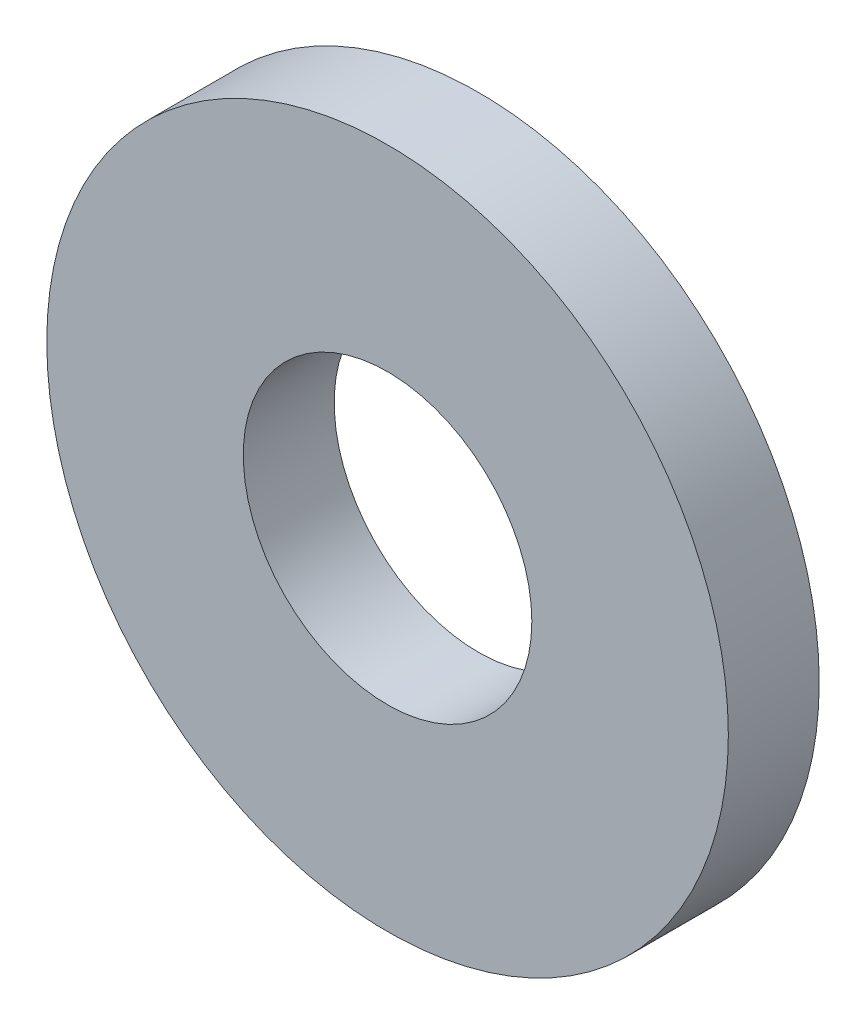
ISO-10303-21;
HEADER;
FILE_DESCRIPTION(('STEP AP214'),'2;1');
FILE_NAME('part.step','',(''),(''),'','','');
FILE_SCHEMA(('AUTOMOTIVE_DESIGN { 1 0 10303 214 1 1 1 1 }'));
ENDSEC;
DATA;
#1=APPLICATION_CONTEXT('core data for automotive mechanical design processes');
#2=APPLICATION_PROTOCOL_DEFINITION('international standard','automotive_design',2000,#1);
#3=PRODUCT_CONTEXT('',#1,'mechanical');
#4=PRODUCT('Part','Part','',(#3));
#5=PRODUCT_RELATED_PRODUCT_CATEGORY('part','',(#4));
#6=PRODUCT_DEFINITION_FORMATION('','',#4);
#7=PRODUCT_DEFINITION_CONTEXT('part definition',#1,'design');
#8=PRODUCT_DEFINITION('design','',#6,#7);
#9=PRODUCT_DEFINITION_SHAPE('','',#8);
#10=(LENGTH_UNIT() NAMED_UNIT(*) SI_UNIT(.MILLI.,.METRE.));
#11=(NAMED_UNIT(*) PLANE_ANGLE_UNIT() SI_UNIT($,.RADIAN.));
#12=(NAMED_UNIT(*) SI_UNIT($,.STERADIAN.) SOLID_ANGLE_UNIT());
#13=UNCERTAINTY_MEASURE_WITH_UNIT(LENGTH_MEASURE(1.E-05),#10,'distance_accuracy_value','');
#14=(GEOMETRIC_REPRESENTATION_CONTEXT(3) GLOBAL_UNCERTAINTY_ASSIGNED_CONTEXT((#13)) GLOBAL_UNIT_ASSIGNED_CONTEXT((#10,
#11,#12)) REPRESENTATION_CONTEXT('',''));
#15=CARTESIAN_POINT('',(0.,0.,0.));
#16=DIRECTION('',(0.,0.,1.));
#17=DIRECTION('',(1.,0.,0.));
#18=AXIS2_PLACEMENT_3D('',#15,#16,#17);
#19=CARTESIAN_POINT('',(0.,0.,4.));
#20=DIRECTION('',(0.,0.,1.));
#21=DIRECTION('',(1.,0.,0.));
#22=AXIS2_PLACEMENT_3D('',#19,#20,#21);
#23=PLANE('',#22);
#24=CARTESIAN_POINT('',(0.,0.,4.));
#25=DIRECTION('',(0.,0.,1.));
#26=DIRECTION('',(1.,0.,0.));
#27=AXIS2_PLACEMENT_3D('',#24,#25,#26);
#28=CIRCLE('',#27,15.);
#29=CARTESIAN_POINT('',(15.,0.,4.));
#30=VERTEX_POINT('',#29);
#31=EDGE_CURVE('E10',#30,#30,#28,.T.);
#32=ORIENTED_EDGE('',*,*,#31,.T.);
#33=EDGE_LOOP('',(#32));
#34=FACE_BOUND('',#33,.T.);
#35=CARTESIAN_POINT('',(0.,0.,4.));
#36=DIRECTION('',(0.,0.,1.));
#37=DIRECTION('',(1.,0.,0.));
#38=AXIS2_PLACEMENT_3D('',#35,#36,#37);
#39=CIRCLE('',#38,6.35);
#40=CARTESIAN_POINT('',(6.35,0.,4.));
#41=VERTEX_POINT('',#40);
#42=EDGE_CURVE('E39',#41,#41,#39,.T.);
#43=ORIENTED_EDGE('',*,*,#42,.F.);
#44=EDGE_LOOP('',(#43));
#45=FACE_BOUND('',#44,.T.);
#46=ADVANCED_FACE('F28',(#34,#45),#23,.T.);
#47=CARTESIAN_POINT('',(0.,0.,0.));
#48=DIRECTION('',(0.,0.,1.));
#49=DIRECTION('',(1.,0.,0.));
#50=AXIS2_PLACEMENT_3D('',#47,#48,#49);
#51=PLANE('',#50);
#52=CARTESIAN_POINT('',(0.,0.,0.));
#53=DIRECTION('',(0.,0.,1.));
#54=DIRECTION('',(1.,0.,0.));
#55=AXIS2_PLACEMENT_3D('',#52,#53,#54);
#56=CIRCLE('',#55,15.);
#57=CARTESIAN_POINT('',(15.,0.,0.));
#58=VERTEX_POINT('',#57);
#59=EDGE_CURVE('E32',#58,#58,#56,.T.);
#60=ORIENTED_EDGE('',*,*,#59,.F.);
#61=EDGE_LOOP('',(#60));
#62=FACE_BOUND('',#61,.T.);
#63=CARTESIAN_POINT('',(0.,0.,0.));
#64=DIRECTION('',(0.,0.,1.));
#65=DIRECTION('',(1.,0.,0.));
#66=AXIS2_PLACEMENT_3D('',#63,#64,#65);
#67=CIRCLE('',#66,6.35);
#68=CARTESIAN_POINT('',(6.35,0.,0.));
#69=VERTEX_POINT('',#68);
#70=EDGE_CURVE('E41',#69,#69,#67,.T.);
#71=ORIENTED_EDGE('',*,*,#70,.T.);
#72=EDGE_LOOP('',(#71));
#73=FACE_BOUND('',#72,.T.);
#74=ADVANCED_FACE('F51',(#62,#73),#51,.F.);
#75=CARTESIAN_POINT('',(0.,0.,4.));
#76=DIRECTION('',(0.,0.,-1.));
#77=DIRECTION('',(-1.,0.,0.));
#78=AXIS2_PLACEMENT_3D('',#75,#76,#77);
#79=CYLINDRICAL_SURFACE('',#78,15.);
#80=ORIENTED_EDGE('',*,*,#31,.F.);
#81=EDGE_LOOP('',(#80));
#82=FACE_BOUND('',#81,.T.);
#83=ORIENTED_EDGE('',*,*,#59,.T.);
#84=EDGE_LOOP('',(#83));
#85=FACE_BOUND('',#84,.T.);
#86=ADVANCED_FACE('F30',(#82,#85),#79,.T.);
#87=CARTESIAN_POINT('',(0.,0.,4.));
#88=DIRECTION('',(0.,0.,-1.));
#89=DIRECTION('',(-1.,0.,0.));
#90=AXIS2_PLACEMENT_3D('',#87,#88,#89);
#91=CYLINDRICAL_SURFACE('',#90,6.35);
#92=ORIENTED_EDGE('',*,*,#42,.T.);
#93=EDGE_LOOP('',(#92));
#94=FACE_BOUND('',#93,.T.);
#95=ORIENTED_EDGE('',*,*,#70,.F.);
#96=EDGE_LOOP('',(#95));
#97=FACE_BOUND('',#96,.T.);
#98=ADVANCED_FACE('F47',(#94,#97),#91,.F.);
#99=CLOSED_SHELL('',(#46,#74,#86,#98));
#100=MANIFOLD_SOLID_BREP('B2',#99);
#101=ADVANCED_BREP_SHAPE_REPRESENTATION('',(#18,#100),#14);
#102=SHAPE_DEFINITION_REPRESENTATION(#9,#101);
ENDSEC;
END-ISO-10303-21;
